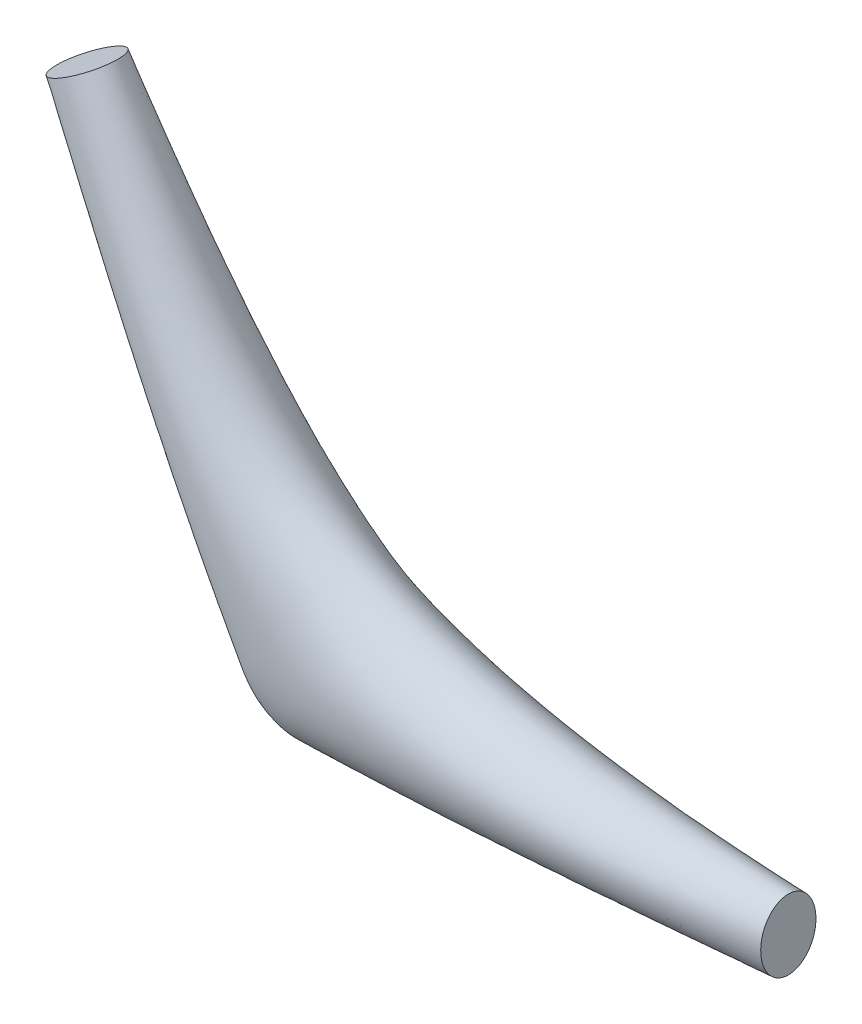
ISO-10303-21;
HEADER;
FILE_DESCRIPTION(('STEP AP214'),'2;1');
FILE_NAME('part.step','',(''),(''),'','','');
FILE_SCHEMA(('AUTOMOTIVE_DESIGN { 1 0 10303 214 1 1 1 1 }'));
ENDSEC;
DATA;
#1=APPLICATION_CONTEXT('core data for automotive mechanical design processes');
#2=APPLICATION_PROTOCOL_DEFINITION('international standard','automotive_design',2000,#1);
#3=PRODUCT_CONTEXT('',#1,'mechanical');
#4=PRODUCT('Part','Part','',(#3));
#5=PRODUCT_RELATED_PRODUCT_CATEGORY('part','',(#4));
#6=PRODUCT_DEFINITION_FORMATION('','',#4);
#7=PRODUCT_DEFINITION_CONTEXT('part definition',#1,'design');
#8=PRODUCT_DEFINITION('design','',#6,#7);
#9=PRODUCT_DEFINITION_SHAPE('','',#8);
#10=(LENGTH_UNIT() NAMED_UNIT(*) SI_UNIT(.MILLI.,.METRE.));
#11=(NAMED_UNIT(*) PLANE_ANGLE_UNIT() SI_UNIT($,.RADIAN.));
#12=(NAMED_UNIT(*) SI_UNIT($,.STERADIAN.) SOLID_ANGLE_UNIT());
#13=UNCERTAINTY_MEASURE_WITH_UNIT(LENGTH_MEASURE(1.E-05),#10,'distance_accuracy_value','');
#14=(GEOMETRIC_REPRESENTATION_CONTEXT(3) GLOBAL_UNCERTAINTY_ASSIGNED_CONTEXT((#13)) GLOBAL_UNIT_ASSIGNED_CONTEXT((#10,
#11,#12)) REPRESENTATION_CONTEXT('',''));
#15=CARTESIAN_POINT('',(0.,0.,0.));
#16=DIRECTION('',(0.,0.,1.));
#17=DIRECTION('',(1.,0.,0.));
#18=AXIS2_PLACEMENT_3D('',#15,#16,#17);
#19=CARTESIAN_POINT('',(-126.999999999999,219.970452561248,0.));
#20=DIRECTION('',(0.499999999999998,-0.86602540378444,0.));
#21=DIRECTION('',(0.86602540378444,0.499999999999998,0.));
#22=AXIS2_PLACEMENT_3D('',#19,#20,#21);
#23=PLANE('',#22);
#24=CARTESIAN_POINT('',(-126.999999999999,219.970452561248,0.));
#25=DIRECTION('',(0.499999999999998,-0.86602540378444,0.));
#26=DIRECTION('',(-0.86602540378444,-0.499999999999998,0.));
#27=AXIS2_PLACEMENT_3D('',#24,#25,#26);
#28=ELLIPSE('',#27,19.05,15.);
#29=CARTESIAN_POINT('',(-143.497783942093,210.445452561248,0.));
#30=VERTEX_POINT('',#29);
#31=EDGE_CURVE('E12',#30,#30,#28,.T.);
#32=ORIENTED_EDGE('',*,*,#31,.F.);
#33=EDGE_LOOP('',(#32));
#34=FACE_BOUND('',#33,.T.);
#35=ADVANCED_FACE('F106',(#34),#23,.F.);
#36=CARTESIAN_POINT('',(254.,0.,0.));
#37=DIRECTION('',(1.,0.,0.));
#38=DIRECTION('',(0.,0.,-1.));
#39=AXIS2_PLACEMENT_3D('',#36,#37,#38);
#40=PLANE('',#39);
#41=CARTESIAN_POINT('',(254.,0.,0.));
#42=DIRECTION('',(1.,0.,0.));
#43=DIRECTION('',(0.,-1.,0.));
#44=AXIS2_PLACEMENT_3D('',#41,#42,#43);
#45=ELLIPSE('',#44,19.05,15.);
#46=CARTESIAN_POINT('',(254.,-19.05,0.));
#47=VERTEX_POINT('',#46);
#48=EDGE_CURVE('E114',#47,#47,#45,.T.);
#49=ORIENTED_EDGE('',*,*,#48,.T.);
#50=EDGE_LOOP('',(#49));
#51=FACE_BOUND('',#50,.T.);
#52=ADVANCED_FACE('F138',(#51),#40,.T.);
#53=CARTESIAN_POINT('',(254.,19.05,0.));
#54=CARTESIAN_POINT('',(172.519908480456,19.05,0.));
#55=CARTESIAN_POINT('',(100.252295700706,23.9745876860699,0.));
#56=CARTESIAN_POINT('',(40.47208234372,52.0600083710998,0.));
#57=CARTESIAN_POINT('',(32.4123793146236,56.1716406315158,0.));
#58=CARTESIAN_POINT('',(24.7163897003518,60.7696566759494,0.));
#59=CARTESIAN_POINT('',(-29.7920387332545,95.9048879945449,0.));
#60=CARTESIAN_POINT('',(-65.2406276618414,151.100081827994,0.));
#61=CARTESIAN_POINT('',(-110.502216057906,229.495452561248,0.));
#62=CARTESIAN_POINT('',(254.,19.05,-0.55911409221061));
#63=CARTESIAN_POINT('',(172.519908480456,19.05,-0.904041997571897));
#64=CARTESIAN_POINT('',(100.252295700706,23.9745876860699,-1.24896990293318));
#65=CARTESIAN_POINT('',(40.47208234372,52.0600083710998,-1.29832826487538));
#66=CARTESIAN_POINT('',(32.4123793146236,56.1716406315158,-1.30185528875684));
#67=CARTESIAN_POINT('',(24.7163897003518,60.7696566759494,-1.29832826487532));
#68=CARTESIAN_POINT('',(-29.7920387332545,95.9048879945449,-1.24896990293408));
#69=CARTESIAN_POINT('',(-65.2406276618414,151.100081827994,-0.904041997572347));
#70=CARTESIAN_POINT('',(-110.502216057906,229.495452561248,-0.55911409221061));
#71=CARTESIAN_POINT('',(254.,18.9695290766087,-1.67716344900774));
#72=CARTESIAN_POINT('',(172.495061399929,18.9291164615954,-2.71186521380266));
#73=CARTESIAN_POINT('',(100.184608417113,23.8036731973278,-3.74656697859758));
#74=CARTESIAN_POINT('',(40.3410756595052,51.8212204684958,-3.89463033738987));
#75=CARTESIAN_POINT('',(32.2732127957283,55.9305351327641,-3.90521057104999));
#76=CARTESIAN_POINT('',(24.5753561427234,60.5374134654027,-3.89463033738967));
#77=CARTESIAN_POINT('',(-29.9053744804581,95.7664826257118,-3.74656697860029));
#78=CARTESIAN_POINT('',(-65.3417234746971,151.033417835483,-2.71186521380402));
#79=CARTESIAN_POINT('',(-110.571905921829,229.455217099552,-1.67716344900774));
#80=CARTESIAN_POINT('',(254.,18.617347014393,-3.321527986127));
#81=CARTESIAN_POINT('',(172.387754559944,18.4039872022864,-5.32899914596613));
#82=CARTESIAN_POINT('',(99.892399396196,23.064117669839,-7.33647030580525));
#83=CARTESIAN_POINT('',(39.7751352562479,50.7895235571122,-7.62373464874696));
#84=CARTESIAN_POINT('',(31.6719860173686,54.8889123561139,-7.64426183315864));
#85=CARTESIAN_POINT('',(23.9659696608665,59.5340590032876,-7.62373464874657));
#86=CARTESIAN_POINT('',(-30.3961347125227,95.1680996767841,-7.3364703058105));
#87=CARTESIAN_POINT('',(-65.7809296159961,150.743886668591,-5.32899914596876));
#88=CARTESIAN_POINT('',(-110.876904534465,229.279126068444,-3.32152798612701));
#89=CARTESIAN_POINT('',(254.,18.0436263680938,-4.9010100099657));
#90=CARTESIAN_POINT('',(172.232311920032,17.5840303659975,-7.78117065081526));
#91=CARTESIAN_POINT('',(99.4566868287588,21.9311974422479,-10.6613312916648));
#92=CARTESIAN_POINT('',(38.9006341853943,49.1917311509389,-11.0734754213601));
#93=CARTESIAN_POINT('',(30.7407627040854,53.2755560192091,-11.102926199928));
#94=CARTESIAN_POINT('',(23.0212915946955,57.9820257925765,-11.0734754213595));
#95=CARTESIAN_POINT('',(-31.1536101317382,94.2636424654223,-10.6613312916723));
#96=CARTESIAN_POINT('',(-66.4745777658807,150.305406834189,-7.78117065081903));
#97=CARTESIAN_POINT('',(-111.373761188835,228.992265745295,-4.90101000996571));
#98=CARTESIAN_POINT('',(254.,17.2718165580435,-6.39485356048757));
#99=CARTESIAN_POINT('',(172.053239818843,16.5320548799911,-10.0333889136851));
#100=CARTESIAN_POINT('',(98.9298571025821,20.5088843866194,-13.6719242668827));
#101=CARTESIAN_POINT('',(37.7857173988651,47.1484854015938,-14.1925900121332));
#102=CARTESIAN_POINT('',(29.5495757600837,51.2117782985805,-14.2297954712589));
#103=CARTESIAN_POINT('',(21.8116799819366,56.0005365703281,-14.1925900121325));
#104=CARTESIAN_POINT('',(-32.1141085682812,93.149401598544,-13.6719242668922));
#105=CARTESIAN_POINT('',(-67.3788711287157,149.767737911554,-10.0333889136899));
#106=CARTESIAN_POINT('',(-112.042168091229,228.606360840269,-6.39485356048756));
#107=CARTESIAN_POINT('',(254.,16.3253670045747,-7.78230267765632));
#108=CARTESIAN_POINT('',(171.871317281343,15.3044137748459,-12.0704975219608));
#109=CARTESIAN_POINT('',(98.3568419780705,18.8882385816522,-16.3586923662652));
#110=CARTESIAN_POINT('',(36.4905418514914,44.7665928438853,-16.9723228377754));
#111=CARTESIAN_POINT('',(28.1604319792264,48.8049897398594,-17.0161713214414));
#112=CARTESIAN_POINT('',(20.3995048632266,53.6949784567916,-16.9723228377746));
#113=CARTESIAN_POINT('',(-33.2213924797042,91.9087558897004,-16.3586923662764));
#114=CARTESIAN_POINT('',(-68.4537402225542,149.174183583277,-12.0704975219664));
#115=CARTESIAN_POINT('',(-112.861817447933,228.133136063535,-7.78230267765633));
#116=CARTESIAN_POINT('',(254.,15.2282340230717,-9.05500426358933));
#117=CARTESIAN_POINT('',(171.700716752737,13.9463667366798,-13.8939495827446));
#118=CARTESIAN_POINT('',(97.7693600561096,17.137626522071,-18.7328949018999));
#119=CARTESIAN_POINT('',(35.061169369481,42.1284698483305,-19.4253364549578));
#120=CARTESIAN_POINT('',(26.6211848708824,46.1380866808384,-19.4748165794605));
#121=CARTESIAN_POINT('',(18.8330613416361,51.1463367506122,-19.4253364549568));
#122=CARTESIAN_POINT('',(-34.4322709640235,90.6022944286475,-18.7328949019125));
#123=CARTESIAN_POINT('',(-69.6654193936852,148.556779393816,-13.8939495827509));
#124=CARTESIAN_POINT('',(-113.811962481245,227.584569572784,-9.05500426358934));
#125=CARTESIAN_POINT('',(254.,14.0043739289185,-10.204605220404));
#126=CARTESIAN_POINT('',(171.550423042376,12.4941882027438,-15.5092224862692));
#127=CARTESIAN_POINT('',(97.1887546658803,15.3074442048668,-20.8138397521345));
#128=CARTESIAN_POINT('',(33.5325441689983,39.2972765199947,-21.5729178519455));
#129=CARTESIAN_POINT('',(24.9685172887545,43.2746173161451,-21.6271596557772));
#130=CARTESIAN_POINT('',(17.1495269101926,48.4163404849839,-21.5729178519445));
#131=CARTESIAN_POINT('',(-35.7139283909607,89.2726358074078,-20.8138397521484));
#132=CARTESIAN_POINT('',(-70.98533062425,147.938575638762,-15.5092224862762));
#133=CARTESIAN_POINT('',(-114.871856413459,226.972639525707,-10.204605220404));
#134=CARTESIAN_POINT('',(254.,12.2302993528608,-11.5714517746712));
#135=CARTESIAN_POINT('',(171.382650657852,10.4660501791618,-17.3976984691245));
#136=CARTESIAN_POINT('',(96.4393680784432,12.8040210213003,-23.2239451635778));
#137=CARTESIAN_POINT('',(31.3941842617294,35.3238725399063,-24.0576671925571));
#138=CARTESIAN_POINT('',(22.6480325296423,39.2539934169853,-24.1172428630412));
#139=CARTESIAN_POINT('',(14.7836063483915,44.59169921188,-24.0576671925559));
#140=CARTESIAN_POINT('',(-37.4880144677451,87.5023643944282,-23.223945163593));
#141=CARTESIAN_POINT('',(-72.8609796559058,147.131019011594,-17.3976984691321));
#142=CARTESIAN_POINT('',(-116.408250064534,226.085602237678,-11.5714517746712));
#143=CARTESIAN_POINT('',(254.,9.79604472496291,-12.9654313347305));
#144=CARTESIAN_POINT('',(171.239488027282,7.81291738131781,-19.2841871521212));
#145=CARTESIAN_POINT('',(95.568266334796,9.61941415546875,-25.6029429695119));
#146=CARTESIAN_POINT('',(28.5829222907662,30.076927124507,-26.5071418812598));
#147=CARTESIAN_POINT('',(19.5817264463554,33.9409799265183,-26.5717536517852));
#148=CARTESIAN_POINT('',(11.6536827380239,39.5532925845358,-26.5071418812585));
#149=CARTESIAN_POINT('',(-39.7832147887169,85.3399651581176,-25.6029429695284));
#150=CARTESIAN_POINT('',(-75.3740907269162,146.17758947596,-19.2841871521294));
#151=CARTESIAN_POINT('',(-118.516376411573,224.868474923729,-12.9654313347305));
#152=CARTESIAN_POINT('',(254.,6.64336626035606,-14.1442699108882));
#153=CARTESIAN_POINT('',(171.164620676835,4.53676287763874,-20.8546363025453));
#154=CARTESIAN_POINT('',(94.6358308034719,5.80138602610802,-27.5650026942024));
#155=CARTESIAN_POINT('',(25.0835597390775,23.5151721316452,-28.5252401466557));
#156=CARTESIAN_POINT('',(15.7441467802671,27.2913992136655,-28.5938562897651));
#157=CARTESIAN_POINT('',(7.73200531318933,33.2682330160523,-28.5252401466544));
#158=CARTESIAN_POINT('',(-42.5871012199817,82.8701172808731,-27.5650026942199));
#159=CARTESIAN_POINT('',(-78.5580445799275,145.140050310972,-20.8546363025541));
#160=CARTESIAN_POINT('',(-121.246676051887,223.292135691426,-14.1442699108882));
#161=CARTESIAN_POINT('',(254.,3.35548406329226,-14.8456060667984));
#162=CARTESIAN_POINT('',(171.159741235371,1.22153815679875,-21.7793496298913));
#163=CARTESIAN_POINT('',(93.7893917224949,2.01156618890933,-28.7130931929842));
#164=CARTESIAN_POINT('',(21.5142048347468,16.8014389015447,-29.705295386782));
#165=CARTESIAN_POINT('',(11.8155424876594,20.4839731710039,-29.7761956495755));
#166=CARTESIAN_POINT('',(3.71448552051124,26.8483867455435,-29.7052953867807));
#167=CARTESIAN_POINT('',(-45.4070460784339,80.5058610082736,-28.7130931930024));
#168=CARTESIAN_POINT('',(-81.8373216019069,144.189475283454,-21.7793496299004));
#169=CARTESIAN_POINT('',(-124.094065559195,221.648194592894,-14.8456060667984));
#170=CARTESIAN_POINT('',(254.,0.,-15.0768985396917));
#171=CARTESIAN_POINT('',(171.191702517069,-2.11002297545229,-22.0839746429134));
#172=CARTESIAN_POINT('',(92.9896444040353,-1.75775210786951,-29.0910507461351));
#173=CARTESIAN_POINT('',(17.9138115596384,10.0185716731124,-30.0937466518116));
#174=CARTESIAN_POINT('',(7.84540257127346,13.6045122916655,-30.1653967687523));
#175=CARTESIAN_POINT('',(-0.346997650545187,20.3680022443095,-30.0937466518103));
#176=CARTESIAN_POINT('',(-48.2313266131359,78.2007979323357,-29.0910507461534));
#177=CARTESIAN_POINT('',(-85.1624134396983,143.28558102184,-22.0839746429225));
#178=CARTESIAN_POINT('',(-126.999999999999,219.970452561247,-15.0768985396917));
#179=CARTESIAN_POINT('',(254.,-3.35548406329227,-14.8456060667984));
#180=CARTESIAN_POINT('',(171.223663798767,-5.44158410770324,-21.7793496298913));
#181=CARTESIAN_POINT('',(92.1898970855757,-5.5270704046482,-28.7130931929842));
#182=CARTESIAN_POINT('',(14.31341828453,3.23570444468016,-29.7052953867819));
#183=CARTESIAN_POINT('',(3.87526265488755,6.72505141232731,-29.7761956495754));
#184=CARTESIAN_POINT('',(-4.40848082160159,13.8876177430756,-29.7052953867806));
#185=CARTESIAN_POINT('',(-51.0556071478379,75.8957348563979,-28.7130931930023));
#186=CARTESIAN_POINT('',(-88.4875052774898,142.381686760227,-21.7793496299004));
#187=CARTESIAN_POINT('',(-129.905934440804,218.292710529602,-14.8456060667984));
#188=CARTESIAN_POINT('',(254.,-6.64336626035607,-14.1442699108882));
#189=CARTESIAN_POINT('',(171.218784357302,-8.75680882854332,-20.8546363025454));
#190=CARTESIAN_POINT('',(91.3434580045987,-9.31689024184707,-27.5650026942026));
#191=CARTESIAN_POINT('',(10.7440633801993,-3.47802878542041,-28.525240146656));
#192=CARTESIAN_POINT('',(-0.0533416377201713,-0.0823746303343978,-28.5938562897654));
#193=CARTESIAN_POINT('',(-8.42600061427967,7.46777147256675,-28.5252401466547));
#194=CARTESIAN_POINT('',(-53.8755520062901,73.5314785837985,-27.5650026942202));
#195=CARTESIAN_POINT('',(-91.7667822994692,141.431111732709,-20.8546363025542));
#196=CARTESIAN_POINT('',(-132.753323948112,216.64876943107,-14.1442699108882));
#197=CARTESIAN_POINT('',(254.,-9.79604472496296,-12.9654313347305));
#198=CARTESIAN_POINT('',(171.143917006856,-12.0329633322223,-19.2841871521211));
#199=CARTESIAN_POINT('',(90.4110224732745,-13.1349183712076,-25.6029429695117));
#200=CARTESIAN_POINT('',(7.24470082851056,-10.0397837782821,-26.5071418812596));
#201=CARTESIAN_POINT('',(-3.89092130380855,-6.73195534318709,-26.571753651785));
#202=CARTESIAN_POINT('',(-12.3476780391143,1.1827119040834,-26.5071418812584));
#203=CARTESIAN_POINT('',(-56.6794384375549,71.0616307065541,-25.6029429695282));
#204=CARTESIAN_POINT('',(-94.9507361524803,140.393572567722,-19.2841871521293));
#205=CARTESIAN_POINT('',(-135.483623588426,215.072430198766,-12.9654313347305));
#206=CARTESIAN_POINT('',(254.,-12.2302993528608,-11.5714517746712));
#207=CARTESIAN_POINT('',(171.000754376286,-14.6860961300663,-17.3976984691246));
#208=CARTESIAN_POINT('',(89.5399207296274,-16.3195252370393,-23.223945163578));
#209=CARTESIAN_POINT('',(4.43343885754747,-15.2867291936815,-24.0576671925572));
#210=CARTESIAN_POINT('',(-6.95722738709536,-12.0449688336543,-24.1172428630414));
#211=CARTESIAN_POINT('',(-15.4776016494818,-3.85569472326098,-24.0576671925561));
#212=CARTESIAN_POINT('',(-58.9746387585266,68.8992314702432,-23.2239451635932));
#213=CARTESIAN_POINT('',(-97.4638472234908,139.440143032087,-17.3976984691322));
#214=CARTESIAN_POINT('',(-137.591749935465,213.855302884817,-11.5714517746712));
#215=CARTESIAN_POINT('',(254.,-14.0043739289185,-10.2046052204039));
#216=CARTESIAN_POINT('',(170.832981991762,-16.7142341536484,-15.5092224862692));
#217=CARTESIAN_POINT('',(88.7905341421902,-18.8229484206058,-20.8138397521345));
#218=CARTESIAN_POINT('',(2.29507895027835,-19.2601331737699,-21.5729178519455));
#219=CARTESIAN_POINT('',(-9.27771214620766,-16.065592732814,-21.6271596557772));
#220=CARTESIAN_POINT('',(-17.843522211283,-7.68033599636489,-21.5729178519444));
#221=CARTESIAN_POINT('',(-60.7487248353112,67.1289600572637,-20.8138397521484));
#222=CARTESIAN_POINT('',(-99.3394962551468,138.632586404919,-15.5092224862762));
#223=CARTESIAN_POINT('',(-139.128143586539,212.968265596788,-10.204605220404));
#224=CARTESIAN_POINT('',(254.,-15.2282340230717,-9.05500426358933));
#225=CARTESIAN_POINT('',(170.682688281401,-18.1664126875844,-13.8939495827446));
#226=CARTESIAN_POINT('',(88.209928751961,-20.65313073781,-18.7328949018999));
#227=CARTESIAN_POINT('',(0.766453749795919,-22.0913265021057,-19.4253364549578));
#228=CARTESIAN_POINT('',(-10.9303797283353,-18.9290620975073,-19.4748165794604));
#229=CARTESIAN_POINT('',(-19.5270566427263,-10.4103322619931,-19.4253364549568));
#230=CARTESIAN_POINT('',(-62.0303822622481,65.7993014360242,-18.7328949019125));
#231=CARTESIAN_POINT('',(-100.659407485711,138.014382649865,-13.8939495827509));
#232=CARTESIAN_POINT('',(-140.188037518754,212.356335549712,-9.05500426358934));
#233=CARTESIAN_POINT('',(254.,-16.3253670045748,-7.78230267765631));
#234=CARTESIAN_POINT('',(170.512087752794,-19.5244597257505,-12.0704975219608));
#235=CARTESIAN_POINT('',(87.6224468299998,-22.4037427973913,-16.3586923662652));
#236=CARTESIAN_POINT('',(-0.662918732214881,-24.7294494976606,-16.9723228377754));
#237=CARTESIAN_POINT('',(-12.4696268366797,-21.5959651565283,-17.0161713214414));
#238=CARTESIAN_POINT('',(-21.0935001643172,-12.9589739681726,-16.9723228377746));
#239=CARTESIAN_POINT('',(-63.2412607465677,64.4928399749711,-16.3586923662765));
#240=CARTESIAN_POINT('',(-101.871086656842,137.396978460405,-12.0704975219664));
#241=CARTESIAN_POINT('',(-141.138182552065,211.80776905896,-7.78230267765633));
#242=CARTESIAN_POINT('',(254.,-17.2718165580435,-6.39485356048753));
#243=CARTESIAN_POINT('',(170.330165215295,-20.7521008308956,-10.0333889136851));
#244=CARTESIAN_POINT('',(87.0494317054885,-24.0243886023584,-13.6719242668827));
#245=CARTESIAN_POINT('',(-1.95809427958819,-27.111342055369,-14.1925900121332));
#246=CARTESIAN_POINT('',(-13.8587706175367,-24.0027537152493,-14.2297954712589));
#247=CARTESIAN_POINT('',(-22.5056752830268,-15.264532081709,-14.1925900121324));
#248=CARTESIAN_POINT('',(-64.3485446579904,63.2521942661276,-13.6719242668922));
#249=CARTESIAN_POINT('',(-102.945955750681,136.803424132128,-10.0333889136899));
#250=CARTESIAN_POINT('',(-141.95783190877,211.334544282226,-6.39485356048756));
#251=CARTESIAN_POINT('',(254.,-18.0436263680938,-4.90101000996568));
#252=CARTESIAN_POINT('',(170.151093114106,-21.8040763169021,-7.78117065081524));
#253=CARTESIAN_POINT('',(86.5226019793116,-25.446701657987,-10.6613312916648));
#254=CARTESIAN_POINT('',(-3.07301106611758,-29.1545878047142,-11.07347542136));
#255=CARTESIAN_POINT('',(-15.0499575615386,-26.066531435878,-11.102926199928));
#256=CARTESIAN_POINT('',(-23.7152868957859,-17.2460213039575,-11.0734754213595));
#257=CARTESIAN_POINT('',(-65.3090430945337,62.1379533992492,-10.6613312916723));
#258=CARTESIAN_POINT('',(-103.850249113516,136.265755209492,-7.78117065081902));
#259=CARTESIAN_POINT('',(-142.626238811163,210.948639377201,-4.9010100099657));
#260=CARTESIAN_POINT('',(254.,-18.617347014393,-3.32152798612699));
#261=CARTESIAN_POINT('',(169.995650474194,-22.624033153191,-5.32899914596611));
#262=CARTESIAN_POINT('',(86.0868894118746,-26.5796218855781,-7.33647030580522));
#263=CARTESIAN_POINT('',(-3.94751213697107,-30.7523802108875,-7.62373464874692));
#264=CARTESIAN_POINT('',(-15.9811808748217,-27.6798877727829,-7.6442618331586));
#265=CARTESIAN_POINT('',(-24.6599649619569,-18.7980545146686,-7.62373464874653));
#266=CARTESIAN_POINT('',(-66.0665185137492,61.2334961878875,-7.33647030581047));
#267=CARTESIAN_POINT('',(-104.543897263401,135.82727537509,-5.32899914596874));
#268=CARTESIAN_POINT('',(-143.123095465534,210.661779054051,-3.32152798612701));
#269=CARTESIAN_POINT('',(254.,-18.9695290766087,-1.67716344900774));
#270=CARTESIAN_POINT('',(169.888343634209,-23.1491624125,-2.71186521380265));
#271=CARTESIAN_POINT('',(85.7946803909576,-27.3191774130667,-3.74656697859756));
#272=CARTESIAN_POINT('',(-4.51345254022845,-31.784077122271,-3.89463033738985));
#273=CARTESIAN_POINT('',(-16.5824076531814,-28.7215105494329,-3.90521057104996));
#274=CARTESIAN_POINT('',(-25.2693514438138,-19.8014089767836,-3.89463033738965));
#275=CARTESIAN_POINT('',(-66.5572787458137,60.6351132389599,-3.74656697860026));
#276=CARTESIAN_POINT('',(-104.9831034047,135.537744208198,-2.711865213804));
#277=CARTESIAN_POINT('',(-143.42809407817,210.485688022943,-1.67716344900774));
#278=CARTESIAN_POINT('',(254.,-19.05,-0.559114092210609));
#279=CARTESIAN_POINT('',(169.863496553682,-23.2700459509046,-0.904041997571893));
#280=CARTESIAN_POINT('',(85.7269931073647,-27.4900919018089,-1.24896990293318));
#281=CARTESIAN_POINT('',(-4.64445922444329,-32.022865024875,-1.29832826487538));
#282=CARTESIAN_POINT('',(-16.7215741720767,-28.9626160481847,-1.30185528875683));
#283=CARTESIAN_POINT('',(-25.4103850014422,-20.0336521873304,-1.29832826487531));
#284=CARTESIAN_POINT('',(-66.6706144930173,60.4967078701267,-1.24896990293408));
#285=CARTESIAN_POINT('',(-105.084199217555,135.471080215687,-0.904041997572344));
#286=CARTESIAN_POINT('',(-143.497783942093,210.445452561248,-0.559114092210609));
#287=CARTESIAN_POINT('',(254.,-19.05,0.559114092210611));
#288=CARTESIAN_POINT('',(169.863496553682,-23.2700459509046,0.904041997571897));
#289=CARTESIAN_POINT('',(85.7269931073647,-27.4900919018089,1.24896990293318));
#290=CARTESIAN_POINT('',(-4.64445922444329,-32.022865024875,1.29832826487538));
#291=CARTESIAN_POINT('',(-16.7215741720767,-28.9626160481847,1.30185528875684));
#292=CARTESIAN_POINT('',(-25.4103850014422,-20.0336521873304,1.29832826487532));
#293=CARTESIAN_POINT('',(-66.6706144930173,60.4967078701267,1.24896990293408));
#294=CARTESIAN_POINT('',(-105.084199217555,135.471080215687,0.904041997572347));
#295=CARTESIAN_POINT('',(-143.497783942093,210.445452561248,0.559114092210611));
#296=CARTESIAN_POINT('',(254.,-18.9695290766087,1.67716344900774));
#297=CARTESIAN_POINT('',(169.888343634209,-23.1491624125,2.71186521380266));
#298=CARTESIAN_POINT('',(85.7946803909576,-27.3191774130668,3.74656697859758));
#299=CARTESIAN_POINT('',(-4.51345254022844,-31.7840771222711,3.89463033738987));
#300=CARTESIAN_POINT('',(-16.5824076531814,-28.721510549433,3.90521057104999));
#301=CARTESIAN_POINT('',(-25.2693514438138,-19.8014089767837,3.89463033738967));
#302=CARTESIAN_POINT('',(-66.5572787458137,60.6351132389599,3.74656697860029));
#303=CARTESIAN_POINT('',(-104.9831034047,135.537744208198,2.71186521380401));
#304=CARTESIAN_POINT('',(-143.42809407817,210.485688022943,1.67716344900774));
#305=CARTESIAN_POINT('',(254.,-18.617347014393,3.321527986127));
#306=CARTESIAN_POINT('',(169.995650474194,-22.6240331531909,5.32899914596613));
#307=CARTESIAN_POINT('',(86.0868894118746,-26.5796218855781,7.33647030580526));
#308=CARTESIAN_POINT('',(-3.9475121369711,-30.7523802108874,7.62373464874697));
#309=CARTESIAN_POINT('',(-15.9811808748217,-27.6798877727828,7.64426183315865));
#310=CARTESIAN_POINT('',(-24.6599649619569,-18.7980545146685,7.62373464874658));
#311=CARTESIAN_POINT('',(-66.0665185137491,61.2334961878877,7.33647030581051));
#312=CARTESIAN_POINT('',(-104.543897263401,135.82727537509,5.32899914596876));
#313=CARTESIAN_POINT('',(-143.123095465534,210.661779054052,3.32152798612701));
#314=CARTESIAN_POINT('',(254.,-18.0436263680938,4.90101000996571));
#315=CARTESIAN_POINT('',(170.151093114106,-21.8040763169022,7.78117065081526));
#316=CARTESIAN_POINT('',(86.5226019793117,-25.446701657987,10.6613312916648));
#317=CARTESIAN_POINT('',(-3.07301106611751,-29.1545878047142,11.0734754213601));
#318=CARTESIAN_POINT('',(-15.0499575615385,-26.0665314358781,11.102926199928));
#319=CARTESIAN_POINT('',(-23.7152868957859,-17.2460213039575,11.0734754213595));
#320=CARTESIAN_POINT('',(-65.3090430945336,62.1379533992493,10.6613312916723));
#321=CARTESIAN_POINT('',(-103.850249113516,136.265755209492,7.78117065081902));
#322=CARTESIAN_POINT('',(-142.626238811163,210.948639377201,4.9010100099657));
#323=CARTESIAN_POINT('',(254.,-17.2718165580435,6.39485356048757));
#324=CARTESIAN_POINT('',(170.330165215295,-20.7521008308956,10.0333889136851));
#325=CARTESIAN_POINT('',(87.0494317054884,-24.0243886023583,13.6719242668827));
#326=CARTESIAN_POINT('',(-1.95809427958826,-27.1113420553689,14.1925900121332));
#327=CARTESIAN_POINT('',(-13.8587706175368,-24.0027537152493,14.2297954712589));
#328=CARTESIAN_POINT('',(-22.5056752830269,-15.264532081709,14.1925900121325));
#329=CARTESIAN_POINT('',(-64.3485446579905,63.2521942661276,13.6719242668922));
#330=CARTESIAN_POINT('',(-102.945955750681,136.803424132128,10.0333889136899));
#331=CARTESIAN_POINT('',(-141.95783190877,211.334544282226,6.39485356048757));
#332=CARTESIAN_POINT('',(254.,-16.3253670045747,7.78230267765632));
#333=CARTESIAN_POINT('',(170.512087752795,-19.5244597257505,12.0704975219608));
#334=CARTESIAN_POINT('',(87.62244683,-22.4037427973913,16.3586923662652));
#335=CARTESIAN_POINT('',(-0.662918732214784,-24.7294494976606,16.9723228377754));
#336=CARTESIAN_POINT('',(-12.4696268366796,-21.5959651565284,17.0161713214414));
#337=CARTESIAN_POINT('',(-21.0935001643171,-12.9589739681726,16.9723228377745));
#338=CARTESIAN_POINT('',(-63.2412607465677,64.4928399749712,16.3586923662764));
#339=CARTESIAN_POINT('',(-101.871086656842,137.396978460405,12.0704975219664));
#340=CARTESIAN_POINT('',(-141.138182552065,211.80776905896,7.78230267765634));
#341=CARTESIAN_POINT('',(254.,-15.2282340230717,9.05500426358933));
#342=CARTESIAN_POINT('',(170.682688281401,-18.1664126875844,13.8939495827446));
#343=CARTESIAN_POINT('',(88.2099287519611,-20.65313073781,18.7328949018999));
#344=CARTESIAN_POINT('',(0.766453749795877,-22.0913265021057,19.4253364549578));
#345=CARTESIAN_POINT('',(-10.9303797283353,-18.9290620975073,19.4748165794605));
#346=CARTESIAN_POINT('',(-19.5270566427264,-10.4103322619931,19.4253364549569));
#347=CARTESIAN_POINT('',(-62.0303822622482,65.7993014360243,18.7328949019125));
#348=CARTESIAN_POINT('',(-100.659407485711,138.014382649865,13.8939495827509));
#349=CARTESIAN_POINT('',(-140.188037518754,212.356335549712,9.05500426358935));
#350=CARTESIAN_POINT('',(254.,-14.0043739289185,10.204605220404));
#351=CARTESIAN_POINT('',(170.832981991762,-16.7142341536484,15.5092224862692));
#352=CARTESIAN_POINT('',(88.7905341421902,-18.8229484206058,20.8138397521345));
#353=CARTESIAN_POINT('',(2.29507895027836,-19.2601331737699,21.5729178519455));
#354=CARTESIAN_POINT('',(-9.27771214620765,-16.065592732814,21.6271596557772));
#355=CARTESIAN_POINT('',(-17.843522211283,-7.68033599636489,21.5729178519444));
#356=CARTESIAN_POINT('',(-60.7487248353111,67.1289600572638,20.8138397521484));
#357=CARTESIAN_POINT('',(-99.3394962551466,138.632586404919,15.5092224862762));
#358=CARTESIAN_POINT('',(-139.128143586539,212.968265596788,10.204605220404));
#359=CARTESIAN_POINT('',(254.,-12.2302993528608,11.5714517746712));
#360=CARTESIAN_POINT('',(171.000754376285,-14.6860961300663,17.3976984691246));
#361=CARTESIAN_POINT('',(89.5399207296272,-16.3195252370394,23.2239451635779));
#362=CARTESIAN_POINT('',(4.43343885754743,-15.2867291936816,24.0576671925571));
#363=CARTESIAN_POINT('',(-6.95722738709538,-12.0449688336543,24.1172428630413));
#364=CARTESIAN_POINT('',(-15.4776016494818,-3.85569472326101,24.057667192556));
#365=CARTESIAN_POINT('',(-58.9746387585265,68.8992314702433,23.2239451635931));
#366=CARTESIAN_POINT('',(-97.4638472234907,139.440143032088,17.3976984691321));
#367=CARTESIAN_POINT('',(-137.591749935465,213.855302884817,11.5714517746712));
#368=CARTESIAN_POINT('',(254.000000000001,-9.79604472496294,12.9654313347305));
#369=CARTESIAN_POINT('',(171.143917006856,-12.0329633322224,19.2841871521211));
#370=CARTESIAN_POINT('',(90.4110224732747,-13.1349183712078,25.6029429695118));
#371=CARTESIAN_POINT('',(7.24470082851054,-10.0397837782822,26.5071418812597));
#372=CARTESIAN_POINT('',(-3.8909213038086,-6.73195534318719,26.5717536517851));
#373=CARTESIAN_POINT('',(-12.3476780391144,1.1827119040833,26.5071418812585));
#374=CARTESIAN_POINT('',(-56.6794384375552,71.0616307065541,25.6029429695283));
#375=CARTESIAN_POINT('',(-94.9507361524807,140.393572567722,19.2841871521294));
#376=CARTESIAN_POINT('',(-135.483623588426,215.072430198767,12.9654313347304));
#377=CARTESIAN_POINT('',(253.999999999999,-6.64336626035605,14.1442699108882));
#378=CARTESIAN_POINT('',(171.218784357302,-8.75680882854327,20.8546363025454));
#379=CARTESIAN_POINT('',(91.3434580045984,-9.31689024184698,27.5650026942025));
#380=CARTESIAN_POINT('',(10.7440633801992,-3.47802878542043,28.5252401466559));
#381=CARTESIAN_POINT('',(-0.0533416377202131,-0.0823746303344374,28.5938562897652));
#382=CARTESIAN_POINT('',(-8.42600061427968,7.46777147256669,28.5252401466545));
#383=CARTESIAN_POINT('',(-53.8755520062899,73.5314785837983,27.56500269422));
#384=CARTESIAN_POINT('',(-91.766782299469,141.431111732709,20.8546363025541));
#385=CARTESIAN_POINT('',(-132.753323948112,216.648769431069,14.1442699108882));
#386=CARTESIAN_POINT('',(254.,-3.35548406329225,14.8456060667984));
#387=CARTESIAN_POINT('',(171.223663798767,-5.44158410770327,21.7793496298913));
#388=CARTESIAN_POINT('',(92.1898970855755,-5.52707040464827,28.7130931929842));
#389=CARTESIAN_POINT('',(14.31341828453,3.23570444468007,29.705295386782));
#390=CARTESIAN_POINT('',(3.87526265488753,6.72505141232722,29.7761956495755));
#391=CARTESIAN_POINT('',(-4.4084808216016,13.8876177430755,29.7052953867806));
#392=CARTESIAN_POINT('',(-51.0556071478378,75.8957348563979,28.7130931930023));
#393=CARTESIAN_POINT('',(-88.4875052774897,142.381686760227,21.7793496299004));
#394=CARTESIAN_POINT('',(-129.905934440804,218.292710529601,14.8456060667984));
#395=CARTESIAN_POINT('',(254.,0.,15.0768985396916));
#396=CARTESIAN_POINT('',(171.191702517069,-2.11002297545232,22.0839746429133));
#397=CARTESIAN_POINT('',(92.9896444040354,-1.7577521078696,29.091050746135));
#398=CARTESIAN_POINT('',(17.9138115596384,10.0185716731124,30.0937466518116));
#399=CARTESIAN_POINT('',(7.84540257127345,13.6045122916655,30.1653967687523));
#400=CARTESIAN_POINT('',(-0.346997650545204,20.3680022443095,30.0937466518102));
#401=CARTESIAN_POINT('',(-48.231326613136,78.2007979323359,29.0910507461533));
#402=CARTESIAN_POINT('',(-85.1624134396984,143.285581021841,22.0839746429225));
#403=CARTESIAN_POINT('',(-127.,219.970452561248,15.0768985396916));
#404=CARTESIAN_POINT('',(254.,3.35548406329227,14.8456060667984));
#405=CARTESIAN_POINT('',(171.159741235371,1.22153815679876,21.7793496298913));
#406=CARTESIAN_POINT('',(93.789391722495,2.01156618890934,28.7130931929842));
#407=CARTESIAN_POINT('',(21.5142048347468,16.8014389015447,29.705295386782));
#408=CARTESIAN_POINT('',(11.8155424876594,20.4839731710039,29.7761956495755));
#409=CARTESIAN_POINT('',(3.71448552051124,26.8483867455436,29.7052953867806));
#410=CARTESIAN_POINT('',(-45.4070460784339,80.5058610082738,28.7130931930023));
#411=CARTESIAN_POINT('',(-81.8373216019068,144.189475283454,21.7793496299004));
#412=CARTESIAN_POINT('',(-124.094065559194,221.648194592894,14.8456060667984));
#413=CARTESIAN_POINT('',(254.,6.64336626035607,14.1442699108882));
#414=CARTESIAN_POINT('',(171.164620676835,4.53676287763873,20.8546363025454));
#415=CARTESIAN_POINT('',(94.6358308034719,5.80138602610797,27.5650026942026));
#416=CARTESIAN_POINT('',(25.0835597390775,23.515172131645,28.5252401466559));
#417=CARTESIAN_POINT('',(15.7441467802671,27.2913992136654,28.5938562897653));
#418=CARTESIAN_POINT('',(7.73200531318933,33.2682330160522,28.5252401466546));
#419=CARTESIAN_POINT('',(-42.5871012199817,82.8701172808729,27.5650026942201));
#420=CARTESIAN_POINT('',(-78.5580445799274,145.140050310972,20.8546363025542));
#421=CARTESIAN_POINT('',(-121.246676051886,223.292135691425,14.1442699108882));
#422=CARTESIAN_POINT('',(254.,9.79604472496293,12.9654313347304));
#423=CARTESIAN_POINT('',(171.239488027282,7.81291738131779,19.2841871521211));
#424=CARTESIAN_POINT('',(95.568266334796,9.61941415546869,25.6029429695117));
#425=CARTESIAN_POINT('',(28.5829222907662,30.0769271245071,26.5071418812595));
#426=CARTESIAN_POINT('',(19.5817264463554,33.9409799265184,26.571753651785));
#427=CARTESIAN_POINT('',(11.6536827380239,39.5532925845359,26.5071418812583));
#428=CARTESIAN_POINT('',(-39.7832147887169,85.3399651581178,25.6029429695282));
#429=CARTESIAN_POINT('',(-75.3740907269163,146.17758947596,19.2841871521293));
#430=CARTESIAN_POINT('',(-118.516376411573,224.86847492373,12.9654313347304));
#431=CARTESIAN_POINT('',(254.,12.2302993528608,11.5714517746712));
#432=CARTESIAN_POINT('',(171.382650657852,10.4660501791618,17.3976984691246));
#433=CARTESIAN_POINT('',(96.4393680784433,12.8040210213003,23.223945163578));
#434=CARTESIAN_POINT('',(31.3941842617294,35.3238725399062,24.0576671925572));
#435=CARTESIAN_POINT('',(22.6480325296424,39.2539934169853,24.1172428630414));
#436=CARTESIAN_POINT('',(14.7836063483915,44.5916992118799,24.0576671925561));
#437=CARTESIAN_POINT('',(-37.4880144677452,87.5023643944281,23.2239451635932));
#438=CARTESIAN_POINT('',(-72.8609796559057,147.131019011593,17.3976984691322));
#439=CARTESIAN_POINT('',(-116.408250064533,226.085602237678,11.5714517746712));
#440=CARTESIAN_POINT('',(254.,14.0043739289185,10.2046052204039));
#441=CARTESIAN_POINT('',(171.550423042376,12.4941882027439,15.5092224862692));
#442=CARTESIAN_POINT('',(97.1887546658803,15.3074442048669,20.8138397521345));
#443=CARTESIAN_POINT('',(33.5325441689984,39.2972765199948,21.5729178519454));
#444=CARTESIAN_POINT('',(24.9685172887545,43.2746173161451,21.6271596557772));
#445=CARTESIAN_POINT('',(17.1495269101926,48.416340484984,21.5729178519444));
#446=CARTESIAN_POINT('',(-35.7139283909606,89.2726358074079,20.8138397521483));
#447=CARTESIAN_POINT('',(-70.9853306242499,147.938575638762,15.5092224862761));
#448=CARTESIAN_POINT('',(-114.871856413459,226.972639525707,10.204605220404));
#449=CARTESIAN_POINT('',(254.,15.2282340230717,9.05500426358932));
#450=CARTESIAN_POINT('',(171.700716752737,13.9463667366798,13.8939495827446));
#451=CARTESIAN_POINT('',(97.7693600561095,17.1376265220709,18.7328949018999));
#452=CARTESIAN_POINT('',(35.0611693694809,42.1284698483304,19.4253364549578));
#453=CARTESIAN_POINT('',(26.6211848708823,46.1380866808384,19.4748165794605));
#454=CARTESIAN_POINT('',(18.833061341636,51.1463367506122,19.4253364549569));
#455=CARTESIAN_POINT('',(-34.4322709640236,90.6022944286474,18.7328949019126));
#456=CARTESIAN_POINT('',(-69.6654193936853,148.556779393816,13.893949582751));
#457=CARTESIAN_POINT('',(-113.811962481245,227.584569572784,9.05500426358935));
#458=CARTESIAN_POINT('',(254.,16.3253670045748,7.7823026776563));
#459=CARTESIAN_POINT('',(171.871317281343,15.3044137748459,12.0704975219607));
#460=CARTESIAN_POINT('',(98.3568419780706,18.8882385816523,16.3586923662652));
#461=CARTESIAN_POINT('',(36.4905418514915,44.7665928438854,16.9723228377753));
#462=CARTESIAN_POINT('',(28.1604319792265,48.8049897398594,17.0161713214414));
#463=CARTESIAN_POINT('',(20.3995048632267,53.6949784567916,16.9723228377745));
#464=CARTESIAN_POINT('',(-33.2213924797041,91.9087558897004,16.3586923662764));
#465=CARTESIAN_POINT('',(-68.4537402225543,149.174183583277,12.0704975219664));
#466=CARTESIAN_POINT('',(-112.861817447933,228.133136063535,7.78230267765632));
#467=CARTESIAN_POINT('',(254.,17.2718165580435,6.39485356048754));
#468=CARTESIAN_POINT('',(172.053239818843,16.5320548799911,10.0333889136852));
#469=CARTESIAN_POINT('',(98.9298571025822,20.5088843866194,13.6719242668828));
#470=CARTESIAN_POINT('',(37.785717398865,47.1484854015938,14.1925900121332));
#471=CARTESIAN_POINT('',(29.5495757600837,51.2117782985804,14.229795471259));
#472=CARTESIAN_POINT('',(21.8116799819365,56.0005365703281,14.1925900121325));
#473=CARTESIAN_POINT('',(-32.1141085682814,93.149401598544,13.6719242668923));
#474=CARTESIAN_POINT('',(-67.3788711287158,149.767737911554,10.0333889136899));
#475=CARTESIAN_POINT('',(-112.042168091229,228.606360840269,6.39485356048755));
#476=CARTESIAN_POINT('',(254.,18.0436263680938,4.90101000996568));
#477=CARTESIAN_POINT('',(172.232311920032,17.5840303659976,7.78117065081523));
#478=CARTESIAN_POINT('',(99.4566868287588,21.9311974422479,10.6613312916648));
#479=CARTESIAN_POINT('',(38.9006341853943,49.1917311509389,11.07347542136));
#480=CARTESIAN_POINT('',(30.7407627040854,53.2755560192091,11.102926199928));
#481=CARTESIAN_POINT('',(23.0212915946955,57.9820257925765,11.0734754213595));
#482=CARTESIAN_POINT('',(-31.1536101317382,94.2636424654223,10.6613312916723));
#483=CARTESIAN_POINT('',(-66.4745777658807,150.305406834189,7.781170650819));
#484=CARTESIAN_POINT('',(-111.373761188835,228.992265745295,4.9010100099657));
#485=CARTESIAN_POINT('',(254.,18.617347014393,3.321527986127));
#486=CARTESIAN_POINT('',(172.387754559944,18.4039872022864,5.32899914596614));
#487=CARTESIAN_POINT('',(99.8923993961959,23.064117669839,7.33647030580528));
#488=CARTESIAN_POINT('',(39.7751352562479,50.7895235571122,7.62373464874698));
#489=CARTESIAN_POINT('',(31.6719860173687,54.8889123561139,7.64426183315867));
#490=CARTESIAN_POINT('',(23.9659696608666,59.5340590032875,7.62373464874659));
#491=CARTESIAN_POINT('',(-30.3961347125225,95.168099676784,7.33647030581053));
#492=CARTESIAN_POINT('',(-65.780929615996,150.743886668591,5.32899914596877));
#493=CARTESIAN_POINT('',(-110.876904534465,229.279126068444,3.32152798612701));
#494=CARTESIAN_POINT('',(254.,18.9695290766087,1.67716344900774));
#495=CARTESIAN_POINT('',(172.495061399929,18.9291164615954,2.71186521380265));
#496=CARTESIAN_POINT('',(100.184608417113,23.8036731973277,3.74656697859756));
#497=CARTESIAN_POINT('',(40.3410756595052,51.8212204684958,3.89463033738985));
#498=CARTESIAN_POINT('',(32.2732127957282,55.930535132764,3.90521057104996));
#499=CARTESIAN_POINT('',(24.5753561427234,60.5374134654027,3.89463033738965));
#500=CARTESIAN_POINT('',(-29.9053744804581,95.7664826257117,3.74656697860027));
#501=CARTESIAN_POINT('',(-65.3417234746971,151.033417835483,2.711865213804));
#502=CARTESIAN_POINT('',(-110.571905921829,229.455217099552,1.67716344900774));
#503=CARTESIAN_POINT('',(254.,19.05,0.559114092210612));
#504=CARTESIAN_POINT('',(172.519908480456,19.05,0.904041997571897));
#505=CARTESIAN_POINT('',(100.252295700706,23.9745876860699,1.24896990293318));
#506=CARTESIAN_POINT('',(40.47208234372,52.0600083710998,1.29832826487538));
#507=CARTESIAN_POINT('',(32.4123793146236,56.1716406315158,1.30185528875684));
#508=CARTESIAN_POINT('',(24.7163897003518,60.7696566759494,1.29832826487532));
#509=CARTESIAN_POINT('',(-29.7920387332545,95.9048879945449,1.24896990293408));
#510=CARTESIAN_POINT('',(-65.2406276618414,151.100081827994,0.904041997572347));
#511=CARTESIAN_POINT('',(-110.502216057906,229.495452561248,0.559114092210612));
#512=CARTESIAN_POINT('',(254.,19.05,0.));
#513=CARTESIAN_POINT('',(172.519908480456,19.05,0.));
#514=CARTESIAN_POINT('',(100.252295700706,23.9745876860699,0.));
#515=CARTESIAN_POINT('',(40.47208234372,52.0600083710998,0.));
#516=CARTESIAN_POINT('',(32.4123793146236,56.1716406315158,0.));
#517=CARTESIAN_POINT('',(24.7163897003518,60.7696566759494,0.));
#518=CARTESIAN_POINT('',(-29.7920387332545,95.9048879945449,0.));
#519=CARTESIAN_POINT('',(-65.2406276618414,151.100081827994,0.));
#520=CARTESIAN_POINT('',(-110.502216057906,229.495452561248,0.));
#521=B_SPLINE_SURFACE_WITH_KNOTS('',3,3,((#53,#54,#55,#56,#57,#58,#59,#60,#61),(#62,#63,#64,#65,
#66,#67,#68,#69,#70),(#71,#72,#73,#74,#75,#76,#77,#78,#79),(#80,#81,#82,#83,#84,#85,#86,#87,
#88),(#89,#90,#91,#92,#93,#94,#95,#96,#97),(#98,#99,#100,#101,#102,#103,#104,#105,#106),(#107,
#108,#109,#110,#111,#112,#113,#114,#115),(#116,#117,#118,#119,#120,#121,#122,#123,#124),(#125,
#126,#127,#128,#129,#130,#131,#132,#133),(#134,#135,#136,#137,#138,#139,#140,#141,#142),(#143,
#144,#145,#146,#147,#148,#149,#150,#151),(#152,#153,#154,#155,#156,#157,#158,#159,#160),(#161,
#162,#163,#164,#165,#166,#167,#168,#169),(#170,#171,#172,#173,#174,#175,#176,#177,#178),(#179,
#180,#181,#182,#183,#184,#185,#186,#187),(#188,#189,#190,#191,#192,#193,#194,#195,#196),(#197,
#198,#199,#200,#201,#202,#203,#204,#205),(#206,#207,#208,#209,#210,#211,#212,#213,#214),(#215,
#216,#217,#218,#219,#220,#221,#222,#223),(#224,#225,#226,#227,#228,#229,#230,#231,#232),(#233,
#234,#235,#236,#237,#238,#239,#240,#241),(#242,#243,#244,#245,#246,#247,#248,#249,#250),(#251,
#252,#253,#254,#255,#256,#257,#258,#259),(#260,#261,#262,#263,#264,#265,#266,#267,#268),(#269,
#270,#271,#272,#273,#274,#275,#276,#277),(#278,#279,#280,#281,#282,#283,#284,#285,#286),(#287,
#288,#289,#290,#291,#292,#293,#294,#295),(#296,#297,#298,#299,#300,#301,#302,#303,#304),(#305,
#306,#307,#308,#309,#310,#311,#312,#313),(#314,#315,#316,#317,#318,#319,#320,#321,#322),(#323,
#324,#325,#326,#327,#328,#329,#330,#331),(#332,#333,#334,#335,#336,#337,#338,#339,#340),(#341,
#342,#343,#344,#345,#346,#347,#348,#349),(#350,#351,#352,#353,#354,#355,#356,#357,#358),(#359,
#360,#361,#362,#363,#364,#365,#366,#367),(#368,#369,#370,#371,#372,#373,#374,#375,#376),(#377,
#378,#379,#380,#381,#382,#383,#384,#385),(#386,#387,#388,#389,#390,#391,#392,#393,#394),(#395,
#396,#397,#398,#399,#400,#401,#402,#403),(#404,#405,#406,#407,#408,#409,#410,#411,#412),(#413,
#414,#415,#416,#417,#418,#419,#420,#421),(#422,#423,#424,#425,#426,#427,#428,#429,#430),(#431,
#432,#433,#434,#435,#436,#437,#438,#439),(#440,#441,#442,#443,#444,#445,#446,#447,#448),(#449,
#450,#451,#452,#453,#454,#455,#456,#457),(#458,#459,#460,#461,#462,#463,#464,#465,#466),(#467,
#468,#469,#470,#471,#472,#473,#474,#475),(#476,#477,#478,#479,#480,#481,#482,#483,#484),(#485,
#486,#487,#488,#489,#490,#491,#492,#493),(#494,#495,#496,#497,#498,#499,#500,#501,#502),(#503,
#504,#505,#506,#507,#508,#509,#510,#511),(#512,#513,#514,#515,#516,#517,#518,#519,#520)),
.UNSPECIFIED.,.T.,.F.,.F.,(4,1,1,1,1,1,1,1,1,1,1,1,1,1,1,1,1,1,1,1,1,1,1,1,2,1,1,1,1,1,1,1,1,1,
1,1,1,1,1,1,1,1,1,1,1,1,1,1,4),(4,2,1,2,4),(0.,0.015625,0.03125,0.046875,0.0625,0.078125,
0.09375,0.109375,0.125,0.15625,0.1875,0.21875,0.25,0.28125,0.3125,0.34375,0.375,0.390625,
0.40625,0.421875,0.4375,0.453125,0.46875,0.484375,0.5,0.515625,0.53125,0.546875,0.5625,0.578125,
0.59375,0.609375,0.625,0.65625,0.6875,0.71875,0.75,0.78125,0.8125,0.84375,0.875,0.890625,
0.90625,0.921875,0.9375,0.953125,0.96875,0.984375,1.),(0.,0.465503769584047,0.500000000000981,
0.534496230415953,1.),.UNSPECIFIED.);
#522=ORIENTED_EDGE('',*,*,#48,.F.);
#523=EDGE_LOOP('',(#522));
#524=FACE_BOUND('',#523,.T.);
#525=ORIENTED_EDGE('',*,*,#31,.T.);
#526=EDGE_LOOP('',(#525));
#527=FACE_BOUND('',#526,.T.);
#528=ADVANCED_FACE('F146',(#524,#527),#521,.T.);
#529=CLOSED_SHELL('',(#35,#52,#528));
#530=MANIFOLD_SOLID_BREP('B2',#529);
#531=ADVANCED_BREP_SHAPE_REPRESENTATION('',(#18,#530),#14);
#532=SHAPE_DEFINITION_REPRESENTATION(#9,#531);
ENDSEC;
END-ISO-10303-21;
